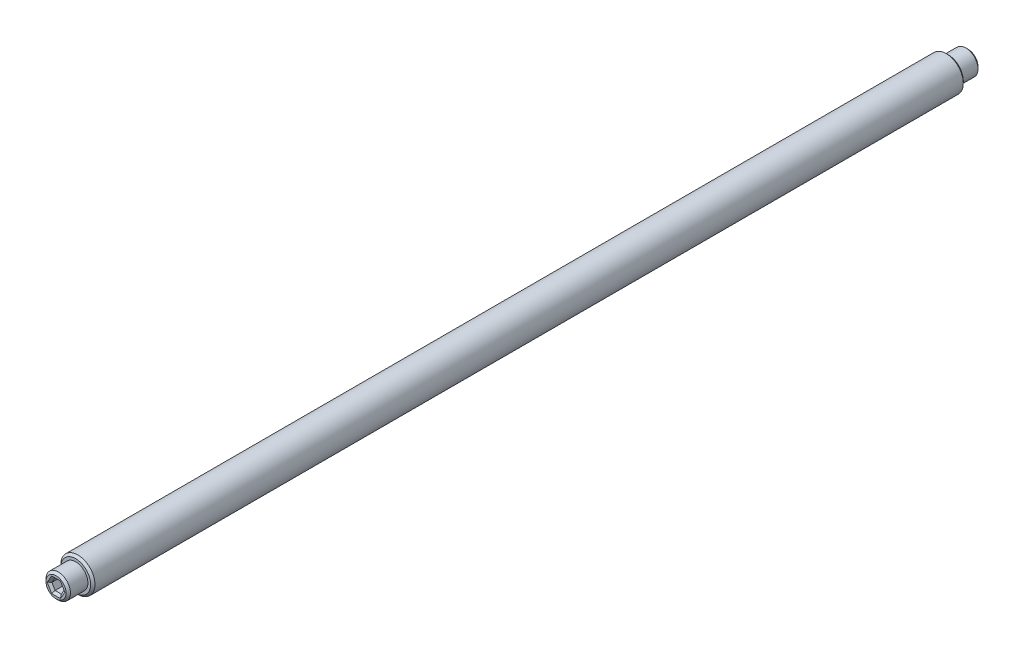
ISO-10303-21;
HEADER;
FILE_DESCRIPTION(('STEP AP214'),'2;1');
FILE_NAME('part.step','',(''),(''),'','','');
FILE_SCHEMA(('AUTOMOTIVE_DESIGN { 1 0 10303 214 1 1 1 1 }'));
ENDSEC;
DATA;
#1=APPLICATION_CONTEXT('core data for automotive mechanical design processes');
#2=APPLICATION_PROTOCOL_DEFINITION('international standard','automotive_design',2000,#1);
#3=PRODUCT_CONTEXT('',#1,'mechanical');
#4=PRODUCT('Part','Part','',(#3));
#5=PRODUCT_RELATED_PRODUCT_CATEGORY('part','',(#4));
#6=PRODUCT_DEFINITION_FORMATION('','',#4);
#7=PRODUCT_DEFINITION_CONTEXT('part definition',#1,'design');
#8=PRODUCT_DEFINITION('design','',#6,#7);
#9=PRODUCT_DEFINITION_SHAPE('','',#8);
#10=(LENGTH_UNIT() NAMED_UNIT(*) SI_UNIT(.MILLI.,.METRE.));
#11=(NAMED_UNIT(*) PLANE_ANGLE_UNIT() SI_UNIT($,.RADIAN.));
#12=(NAMED_UNIT(*) SI_UNIT($,.STERADIAN.) SOLID_ANGLE_UNIT());
#13=UNCERTAINTY_MEASURE_WITH_UNIT(LENGTH_MEASURE(1.E-05),#10,'distance_accuracy_value','');
#14=(GEOMETRIC_REPRESENTATION_CONTEXT(3) GLOBAL_UNCERTAINTY_ASSIGNED_CONTEXT((#13)) GLOBAL_UNIT_ASSIGNED_CONTEXT((#10,
#11,#12)) REPRESENTATION_CONTEXT('',''));
#15=CARTESIAN_POINT('',(0.,0.,0.));
#16=DIRECTION('',(0.,0.,1.));
#17=DIRECTION('',(1.,0.,0.));
#18=AXIS2_PLACEMENT_3D('',#15,#16,#17);
#19=CARTESIAN_POINT('',(-1.4224,0.,46.736));
#20=DIRECTION('',(0.,0.,1.));
#21=DIRECTION('',(0.,-1.,0.));
#22=AXIS2_PLACEMENT_3D('',#19,#20,#21);
#23=PLANE('',#22);
#24=CARTESIAN_POINT('',(0.,0.,46.736));
#25=DIRECTION('',(0.,0.,1.));
#26=DIRECTION('',(0.,-1.,0.));
#27=AXIS2_PLACEMENT_3D('',#24,#25,#26);
#28=CIRCLE('',#27,1.1684);
#29=CARTESIAN_POINT('',(0.,-1.1684,46.736));
#30=VERTEX_POINT('',#29);
#31=EDGE_CURVE('P0_E126',#30,#30,#28,.F.);
#32=ORIENTED_EDGE('',*,*,#31,.T.);
#33=EDGE_LOOP('',(#32));
#34=FACE_BOUND('',#33,.T.);
#35=ADVANCED_FACE('P0_F16',(#34),#23,.F.);
#36=CARTESIAN_POINT('',(0.,0.,53.086));
#37=DIRECTION('',(0.,0.,-1.));
#38=DIRECTION('',(0.,1.,0.));
#39=AXIS2_PLACEMENT_3D('',#36,#37,#38);
#40=PLANE('',#39);
#41=DIRECTION('',(0.5,-0.866025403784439,0.));
#42=VECTOR('',#41,1.);
#43=CARTESIAN_POINT('',(0.769896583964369,0.444499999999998,53.086));
#44=LINE('',#43,#42);
#45=CARTESIAN_POINT('',(0.513264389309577,0.889000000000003,53.086));
#46=VERTEX_POINT('',#45);
#47=CARTESIAN_POINT('',(1.02652877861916,0.,53.086));
#48=VERTEX_POINT('',#47);
#49=EDGE_CURVE('P0_E157',#46,#48,#44,.T.);
#50=ORIENTED_EDGE('',*,*,#49,.T.);
#51=DIRECTION('',(-0.5,-0.866025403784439,0.));
#52=VECTOR('',#51,1.);
#53=CARTESIAN_POINT('',(0.769896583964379,-0.444500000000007,53.086));
#54=LINE('',#53,#52);
#55=CARTESIAN_POINT('',(0.513264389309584,-0.889000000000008,53.086));
#56=VERTEX_POINT('',#55);
#57=EDGE_CURVE('P0_E159',#48,#56,#54,.T.);
#58=ORIENTED_EDGE('',*,*,#57,.T.);
#59=DIRECTION('',(-1.,0.,0.));
#60=VECTOR('',#59,1.);
#61=CARTESIAN_POINT('',(0.,-0.889000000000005,53.086));
#62=LINE('',#61,#60);
#63=CARTESIAN_POINT('',(-0.513264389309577,-0.889000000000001,53.086));
#64=VERTEX_POINT('',#63);
#65=EDGE_CURVE('P0_E149',#56,#64,#62,.T.);
#66=ORIENTED_EDGE('',*,*,#65,.T.);
#67=DIRECTION('',(-0.5,0.866025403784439,0.));
#68=VECTOR('',#67,1.);
#69=CARTESIAN_POINT('',(-0.769896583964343,-0.444500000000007,53.086));
#70=LINE('',#69,#68);
#71=CARTESIAN_POINT('',(-1.02652877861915,0.,53.086));
#72=VERTEX_POINT('',#71);
#73=EDGE_CURVE('P0_E151',#64,#72,#70,.T.);
#74=ORIENTED_EDGE('',*,*,#73,.T.);
#75=DIRECTION('',(0.5,0.866025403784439,0.));
#76=VECTOR('',#75,1.);
#77=CARTESIAN_POINT('',(-0.769896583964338,0.444499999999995,53.086));
#78=LINE('',#77,#76);
#79=CARTESIAN_POINT('',(-0.513264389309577,0.889000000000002,53.086));
#80=VERTEX_POINT('',#79);
#81=EDGE_CURVE('P0_E153',#72,#80,#78,.T.);
#82=ORIENTED_EDGE('',*,*,#81,.T.);
#83=DIRECTION('',(1.,0.,0.));
#84=VECTOR('',#83,1.);
#85=CARTESIAN_POINT('',(0.,0.888999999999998,53.086));
#86=LINE('',#85,#84);
#87=EDGE_CURVE('P0_E155',#80,#46,#86,.T.);
#88=ORIENTED_EDGE('',*,*,#87,.T.);
#89=EDGE_LOOP('',(#50,#58,#66,#74,#82,#88));
#90=FACE_BOUND('',#89,.T.);
#91=CARTESIAN_POINT('',(0.,0.,53.086));
#92=DIRECTION('',(0.,0.,-1.));
#93=DIRECTION('',(0.,1.,0.));
#94=AXIS2_PLACEMENT_3D('',#91,#92,#93);
#95=CIRCLE('',#94,1.1684);
#96=CARTESIAN_POINT('',(0.,1.1684,53.086));
#97=VERTEX_POINT('',#96);
#98=EDGE_CURVE('P0_E143',#97,#97,#95,.F.);
#99=ORIENTED_EDGE('',*,*,#98,.T.);
#100=EDGE_LOOP('',(#99));
#101=FACE_BOUND('',#100,.T.);
#102=ADVANCED_FACE('P0_F208',(#90,#101),#40,.F.);
#103=CARTESIAN_POINT('',(0.,0.,46.736));
#104=DIRECTION('',(0.,0.,-1.));
#105=DIRECTION('',(0.,1.,0.));
#106=AXIS2_PLACEMENT_3D('',#103,#104,#105);
#107=CYLINDRICAL_SURFACE('',#106,1.4224);
#108=CARTESIAN_POINT('',(0.,0.,46.99));
#109=DIRECTION('',(0.,0.,1.));
#110=DIRECTION('',(0.,-1.,0.));
#111=AXIS2_PLACEMENT_3D('',#108,#109,#110);
#112=CIRCLE('',#111,1.4224);
#113=CARTESIAN_POINT('',(0.,-1.4224,46.99));
#114=VERTEX_POINT('',#113);
#115=EDGE_CURVE('P0_E140',#114,#114,#112,.T.);
#116=ORIENTED_EDGE('',*,*,#115,.T.);
#117=EDGE_LOOP('',(#116));
#118=FACE_BOUND('',#117,.T.);
#119=CARTESIAN_POINT('',(0.,0.,52.832));
#120=DIRECTION('',(0.,0.,-1.));
#121=DIRECTION('',(0.,1.,0.));
#122=AXIS2_PLACEMENT_3D('',#119,#120,#121);
#123=CIRCLE('',#122,1.4224);
#124=CARTESIAN_POINT('',(0.,1.4224,52.832));
#125=VERTEX_POINT('',#124);
#126=EDGE_CURVE('P0_E137',#125,#125,#123,.T.);
#127=ORIENTED_EDGE('',*,*,#126,.T.);
#128=EDGE_LOOP('',(#127));
#129=FACE_BOUND('',#128,.T.);
#130=ADVANCED_FACE('P0_F211',(#118,#129),#107,.T.);
#131=CARTESIAN_POINT('',(0.,0.,46.736));
#132=DIRECTION('',(0.,0.,1.));
#133=DIRECTION('',(0.,-1.,0.));
#134=AXIS2_PLACEMENT_3D('',#131,#132,#133);
#135=CONICAL_SURFACE('',#134,1.1684,0.785398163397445);
#136=ORIENTED_EDGE('',*,*,#115,.F.);
#137=EDGE_LOOP('',(#136));
#138=FACE_BOUND('',#137,.T.);
#139=ORIENTED_EDGE('',*,*,#31,.F.);
#140=EDGE_LOOP('',(#139));
#141=FACE_BOUND('',#140,.T.);
#142=ADVANCED_FACE('P0_F218',(#138,#141),#135,.T.);
#143=CARTESIAN_POINT('',(0.,0.,52.832));
#144=DIRECTION('',(0.,0.,-1.));
#145=DIRECTION('',(0.,1.,0.));
#146=AXIS2_PLACEMENT_3D('',#143,#144,#145);
#147=CONICAL_SURFACE('',#146,1.4224,0.78539816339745);
#148=ORIENTED_EDGE('',*,*,#98,.F.);
#149=EDGE_LOOP('',(#148));
#150=FACE_BOUND('',#149,.T.);
#151=ORIENTED_EDGE('',*,*,#126,.F.);
#152=EDGE_LOOP('',(#151));
#153=FACE_BOUND('',#152,.T.);
#154=ADVANCED_FACE('P0_F215',(#150,#153),#147,.T.);
#155=CARTESIAN_POINT('',(0.733234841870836,0.,51.816));
#156=DIRECTION('',(0.866025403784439,0.5,0.));
#157=DIRECTION('',(-0.5,0.866025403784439,0.));
#158=AXIS2_PLACEMENT_3D('',#155,#156,#157);
#159=PLANE('',#158);
#160=DIRECTION('',(0.,0.,1.));
#161=VECTOR('',#160,1.);
#162=CARTESIAN_POINT('',(0.733234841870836,0.,51.816));
#163=LINE('',#162,#161);
#164=CARTESIAN_POINT('',(0.733234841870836,0.,51.816));
#165=VERTEX_POINT('',#164);
#166=CARTESIAN_POINT('',(0.733234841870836,0.,52.832));
#167=VERTEX_POINT('',#166);
#168=EDGE_CURVE('P0_E124',#165,#167,#163,.T.);
#169=ORIENTED_EDGE('',*,*,#168,.T.);
#170=DIRECTION('',(-0.5,0.866025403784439,0.));
#171=VECTOR('',#170,1.);
#172=CARTESIAN_POINT('',(0.733234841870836,0.,52.832));
#173=LINE('',#172,#171);
#174=CARTESIAN_POINT('',(0.366617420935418,0.635000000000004,52.832));
#175=VERTEX_POINT('',#174);
#176=EDGE_CURVE('P0_E96',#167,#175,#173,.T.);
#177=ORIENTED_EDGE('',*,*,#176,.T.);
#178=DIRECTION('',(0.,0.,1.));
#179=VECTOR('',#178,1.);
#180=CARTESIAN_POINT('',(0.366617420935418,0.635000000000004,51.816));
#181=LINE('',#180,#179);
#182=CARTESIAN_POINT('',(0.366617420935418,0.635000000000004,51.816));
#183=VERTEX_POINT('',#182);
#184=EDGE_CURVE('P0_E88',#183,#175,#181,.T.);
#185=ORIENTED_EDGE('',*,*,#184,.F.);
#186=DIRECTION('',(-0.5,0.866025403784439,0.));
#187=VECTOR('',#186,1.);
#188=CARTESIAN_POINT('',(0.733234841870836,0.,51.816));
#189=LINE('',#188,#187);
#190=EDGE_CURVE('P0_E93',#165,#183,#189,.T.);
#191=ORIENTED_EDGE('',*,*,#190,.F.);
#192=EDGE_LOOP('',(#169,#177,#185,#191));
#193=FACE_BOUND('',#192,.T.);
#194=ADVANCED_FACE('P0_F91',(#193),#159,.F.);
#195=CARTESIAN_POINT('',(0.366617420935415,-0.634999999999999,51.816));
#196=DIRECTION('',(0.866025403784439,-0.5,0.));
#197=DIRECTION('',(0.5,0.866025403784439,0.));
#198=AXIS2_PLACEMENT_3D('',#195,#196,#197);
#199=PLANE('',#198);
#200=DIRECTION('',(0.,0.,1.));
#201=VECTOR('',#200,1.);
#202=CARTESIAN_POINT('',(0.366617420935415,-0.634999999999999,51.816));
#203=LINE('',#202,#201);
#204=CARTESIAN_POINT('',(0.366617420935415,-0.634999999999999,51.816));
#205=VERTEX_POINT('',#204);
#206=CARTESIAN_POINT('',(0.366617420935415,-0.634999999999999,52.832));
#207=VERTEX_POINT('',#206);
#208=EDGE_CURVE('P0_E127',#205,#207,#203,.T.);
#209=ORIENTED_EDGE('',*,*,#208,.T.);
#210=DIRECTION('',(0.5,0.866025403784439,0.));
#211=VECTOR('',#210,1.);
#212=CARTESIAN_POINT('',(0.366617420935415,-0.634999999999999,52.832));
#213=LINE('',#212,#211);
#214=EDGE_CURVE('P0_E146',#207,#167,#213,.T.);
#215=ORIENTED_EDGE('',*,*,#214,.T.);
#216=ORIENTED_EDGE('',*,*,#168,.F.);
#217=DIRECTION('',(0.5,0.866025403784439,0.));
#218=VECTOR('',#217,1.);
#219=CARTESIAN_POINT('',(0.366617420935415,-0.634999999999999,51.816));
#220=LINE('',#219,#218);
#221=EDGE_CURVE('P0_E100',#205,#165,#220,.T.);
#222=ORIENTED_EDGE('',*,*,#221,.F.);
#223=EDGE_LOOP('',(#209,#215,#216,#222));
#224=FACE_BOUND('',#223,.T.);
#225=ADVANCED_FACE('P0_F199',(#224),#199,.F.);
#226=CARTESIAN_POINT('',(-0.366617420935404,-0.634999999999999,51.816));
#227=DIRECTION('',(0.,-1.,0.));
#228=DIRECTION('',(1.,0.,0.));
#229=AXIS2_PLACEMENT_3D('',#226,#227,#228);
#230=PLANE('',#229);
#231=DIRECTION('',(0.,0.,1.));
#232=VECTOR('',#231,1.);
#233=CARTESIAN_POINT('',(-0.366617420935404,-0.634999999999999,51.816));
#234=LINE('',#233,#232);
#235=CARTESIAN_POINT('',(-0.366617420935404,-0.634999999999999,51.816));
#236=VERTEX_POINT('',#235);
#237=CARTESIAN_POINT('',(-0.366617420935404,-0.634999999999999,52.832));
#238=VERTEX_POINT('',#237);
#239=EDGE_CURVE('P0_E130',#236,#238,#234,.T.);
#240=ORIENTED_EDGE('',*,*,#239,.T.);
#241=DIRECTION('',(1.,0.,0.));
#242=VECTOR('',#241,1.);
#243=CARTESIAN_POINT('',(-0.366617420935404,-0.634999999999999,52.832));
#244=LINE('',#243,#242);
#245=EDGE_CURVE('P0_E11',#238,#207,#244,.T.);
#246=ORIENTED_EDGE('',*,*,#245,.T.);
#247=ORIENTED_EDGE('',*,*,#208,.F.);
#248=DIRECTION('',(1.,0.,0.));
#249=VECTOR('',#248,1.);
#250=CARTESIAN_POINT('',(-0.366617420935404,-0.634999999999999,51.816));
#251=LINE('',#250,#249);
#252=EDGE_CURVE('P0_E121',#236,#205,#251,.T.);
#253=ORIENTED_EDGE('',*,*,#252,.F.);
#254=EDGE_LOOP('',(#240,#246,#247,#253));
#255=FACE_BOUND('',#254,.T.);
#256=ADVANCED_FACE('P0_F196',(#255),#230,.F.);
#257=CARTESIAN_POINT('',(-0.733234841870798,0.,51.816));
#258=DIRECTION('',(-0.866025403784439,-0.5,0.));
#259=DIRECTION('',(0.5,-0.866025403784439,0.));
#260=AXIS2_PLACEMENT_3D('',#257,#258,#259);
#261=PLANE('',#260);
#262=DIRECTION('',(0.,0.,1.));
#263=VECTOR('',#262,1.);
#264=CARTESIAN_POINT('',(-0.733234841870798,0.,51.816));
#265=LINE('',#264,#263);
#266=CARTESIAN_POINT('',(-0.733234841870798,0.,51.816));
#267=VERTEX_POINT('',#266);
#268=CARTESIAN_POINT('',(-0.733234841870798,0.,52.832));
#269=VERTEX_POINT('',#268);
#270=EDGE_CURVE('P0_E132',#267,#269,#265,.T.);
#271=ORIENTED_EDGE('',*,*,#270,.T.);
#272=DIRECTION('',(0.5,-0.866025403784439,0.));
#273=VECTOR('',#272,1.);
#274=CARTESIAN_POINT('',(-0.733234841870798,0.,52.832));
#275=LINE('',#274,#273);
#276=EDGE_CURVE('P0_E25',#269,#238,#275,.T.);
#277=ORIENTED_EDGE('',*,*,#276,.T.);
#278=ORIENTED_EDGE('',*,*,#239,.F.);
#279=DIRECTION('',(0.5,-0.866025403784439,0.));
#280=VECTOR('',#279,1.);
#281=CARTESIAN_POINT('',(-0.733234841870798,0.,51.816));
#282=LINE('',#281,#280);
#283=EDGE_CURVE('P0_E118',#267,#236,#282,.T.);
#284=ORIENTED_EDGE('',*,*,#283,.F.);
#285=EDGE_LOOP('',(#271,#277,#278,#284));
#286=FACE_BOUND('',#285,.T.);
#287=ADVANCED_FACE('P0_F263',(#286),#261,.F.);
#288=CARTESIAN_POINT('',(-0.366617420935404,0.635000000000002,51.816));
#289=DIRECTION('',(-0.866025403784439,0.5,0.));
#290=DIRECTION('',(-0.5,-0.866025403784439,0.));
#291=AXIS2_PLACEMENT_3D('',#288,#289,#290);
#292=PLANE('',#291);
#293=DIRECTION('',(0.,0.,1.));
#294=VECTOR('',#293,1.);
#295=CARTESIAN_POINT('',(-0.366617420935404,0.635000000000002,51.816));
#296=LINE('',#295,#294);
#297=CARTESIAN_POINT('',(-0.366617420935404,0.635000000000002,51.816));
#298=VERTEX_POINT('',#297);
#299=CARTESIAN_POINT('',(-0.366617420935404,0.635000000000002,52.832));
#300=VERTEX_POINT('',#299);
#301=EDGE_CURVE('P0_E99',#298,#300,#296,.T.);
#302=ORIENTED_EDGE('',*,*,#301,.T.);
#303=DIRECTION('',(-0.5,-0.866025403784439,0.));
#304=VECTOR('',#303,1.);
#305=CARTESIAN_POINT('',(-0.366617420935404,0.635000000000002,52.832));
#306=LINE('',#305,#304);
#307=EDGE_CURVE('P0_E40',#300,#269,#306,.T.);
#308=ORIENTED_EDGE('',*,*,#307,.T.);
#309=ORIENTED_EDGE('',*,*,#270,.F.);
#310=DIRECTION('',(-0.5,-0.866025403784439,0.));
#311=VECTOR('',#310,1.);
#312=CARTESIAN_POINT('',(-0.366617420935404,0.635000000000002,51.816));
#313=LINE('',#312,#311);
#314=EDGE_CURVE('P0_E108',#298,#267,#313,.T.);
#315=ORIENTED_EDGE('',*,*,#314,.F.);
#316=EDGE_LOOP('',(#302,#308,#309,#315));
#317=FACE_BOUND('',#316,.T.);
#318=ADVANCED_FACE('P0_F256',(#317),#292,.F.);
#319=CARTESIAN_POINT('',(0.366617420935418,0.635000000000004,51.816));
#320=DIRECTION('',(0.,1.,0.));
#321=DIRECTION('',(-1.,0.,0.));
#322=AXIS2_PLACEMENT_3D('',#319,#320,#321);
#323=PLANE('',#322);
#324=ORIENTED_EDGE('',*,*,#184,.T.);
#325=DIRECTION('',(-1.,0.,0.));
#326=VECTOR('',#325,1.);
#327=CARTESIAN_POINT('',(0.366617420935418,0.635000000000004,52.832));
#328=LINE('',#327,#326);
#329=EDGE_CURVE('P0_E163',#175,#300,#328,.T.);
#330=ORIENTED_EDGE('',*,*,#329,.T.);
#331=ORIENTED_EDGE('',*,*,#301,.F.);
#332=DIRECTION('',(-1.,0.,0.));
#333=VECTOR('',#332,1.);
#334=CARTESIAN_POINT('',(0.366617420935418,0.635000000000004,51.816));
#335=LINE('',#334,#333);
#336=EDGE_CURVE('P0_E103',#183,#298,#335,.T.);
#337=ORIENTED_EDGE('',*,*,#336,.F.);
#338=EDGE_LOOP('',(#324,#330,#331,#337));
#339=FACE_BOUND('',#338,.T.);
#340=ADVANCED_FACE('P0_F104',(#339),#323,.F.);
#341=CARTESIAN_POINT('',(1.09985226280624,-0.635000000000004,51.816));
#342=DIRECTION('',(0.,0.,-1.));
#343=DIRECTION('',(0.,1.,0.));
#344=AXIS2_PLACEMENT_3D('',#341,#342,#343);
#345=PLANE('',#344);
#346=ORIENTED_EDGE('',*,*,#190,.T.);
#347=ORIENTED_EDGE('',*,*,#336,.T.);
#348=ORIENTED_EDGE('',*,*,#314,.T.);
#349=ORIENTED_EDGE('',*,*,#283,.T.);
#350=ORIENTED_EDGE('',*,*,#252,.T.);
#351=ORIENTED_EDGE('',*,*,#221,.T.);
#352=EDGE_LOOP('',(#346,#347,#348,#349,#350,#351));
#353=FACE_BOUND('',#352,.T.);
#354=ADVANCED_FACE('P0_F110',(#353),#345,.F.);
#355=CARTESIAN_POINT('',(-0.366617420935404,0.635000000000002,52.832));
#356=DIRECTION('',(-0.612372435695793,0.353553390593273,-0.707106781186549));
#357=DIRECTION('',(0.755928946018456,0.,-0.654653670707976));
#358=AXIS2_PLACEMENT_3D('',#355,#356,#357);
#359=PLANE('',#358);
#360=DIRECTION('',(-0.377964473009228,0.654653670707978,0.654653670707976));
#361=VECTOR('',#360,1.);
#362=CARTESIAN_POINT('',(-0.261869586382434,0.453571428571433,52.6505714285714));
#363=LINE('',#362,#361);
#364=EDGE_CURVE('P0_E115',#80,#300,#363,.F.);
#365=ORIENTED_EDGE('',*,*,#364,.F.);
#366=ORIENTED_EDGE('',*,*,#81,.F.);
#367=DIRECTION('',(-0.755928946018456,0.,0.654653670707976));
#368=VECTOR('',#367,1.);
#369=CARTESIAN_POINT('',(-0.523739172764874,0.,52.6505714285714));
#370=LINE('',#369,#368);
#371=EDGE_CURVE('P0_E20',#269,#72,#370,.T.);
#372=ORIENTED_EDGE('',*,*,#371,.F.);
#373=ORIENTED_EDGE('',*,*,#307,.F.);
#374=EDGE_LOOP('',(#365,#366,#372,#373));
#375=FACE_BOUND('',#374,.T.);
#376=ADVANCED_FACE('P0_F18',(#375),#359,.F.);
#377=CARTESIAN_POINT('',(-0.733234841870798,0.,52.832));
#378=DIRECTION('',(-0.612372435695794,-0.353553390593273,-0.707106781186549));
#379=DIRECTION('',(0.755928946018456,0.,-0.654653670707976));
#380=AXIS2_PLACEMENT_3D('',#377,#378,#379);
#381=PLANE('',#380);
#382=ORIENTED_EDGE('',*,*,#371,.T.);
#383=ORIENTED_EDGE('',*,*,#73,.F.);
#384=DIRECTION('',(-0.377964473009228,-0.654653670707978,0.654653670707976));
#385=VECTOR('',#384,1.);
#386=CARTESIAN_POINT('',(-0.261869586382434,-0.453571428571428,52.6505714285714));
#387=LINE('',#386,#385);
#388=EDGE_CURVE('P0_E174',#238,#64,#387,.T.);
#389=ORIENTED_EDGE('',*,*,#388,.F.);
#390=ORIENTED_EDGE('',*,*,#276,.F.);
#391=EDGE_LOOP('',(#382,#383,#389,#390));
#392=FACE_BOUND('',#391,.T.);
#393=ADVANCED_FACE('P0_F188',(#392),#381,.F.);
#394=CARTESIAN_POINT('',(0.366617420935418,0.635000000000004,52.832));
#395=DIRECTION('',(0.,0.707106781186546,-0.707106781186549));
#396=DIRECTION('',(0.,0.707106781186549,0.707106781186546));
#397=AXIS2_PLACEMENT_3D('',#394,#395,#396);
#398=PLANE('',#397);
#399=ORIENTED_EDGE('',*,*,#364,.T.);
#400=ORIENTED_EDGE('',*,*,#329,.F.);
#401=DIRECTION('',(0.377964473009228,0.654653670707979,0.654653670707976));
#402=VECTOR('',#401,1.);
#403=CARTESIAN_POINT('',(0.261869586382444,0.453571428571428,52.6505714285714));
#404=LINE('',#403,#402);
#405=EDGE_CURVE('P0_E171',#46,#175,#404,.F.);
#406=ORIENTED_EDGE('',*,*,#405,.F.);
#407=ORIENTED_EDGE('',*,*,#87,.F.);
#408=EDGE_LOOP('',(#399,#400,#406,#407));
#409=FACE_BOUND('',#408,.T.);
#410=ADVANCED_FACE('P0_F180',(#409),#398,.F.);
#411=CARTESIAN_POINT('',(-0.366617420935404,-0.634999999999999,52.832));
#412=DIRECTION('',(0.,-0.707106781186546,-0.707106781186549));
#413=DIRECTION('',(0.,0.707106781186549,-0.707106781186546));
#414=AXIS2_PLACEMENT_3D('',#411,#412,#413);
#415=PLANE('',#414);
#416=ORIENTED_EDGE('',*,*,#388,.T.);
#417=ORIENTED_EDGE('',*,*,#65,.F.);
#418=DIRECTION('',(-0.377964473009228,0.654653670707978,-0.654653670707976));
#419=VECTOR('',#418,1.);
#420=CARTESIAN_POINT('',(0.366617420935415,-0.634999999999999,52.832));
#421=LINE('',#420,#419);
#422=EDGE_CURVE('P0_E169',#207,#56,#421,.F.);
#423=ORIENTED_EDGE('',*,*,#422,.F.);
#424=ORIENTED_EDGE('',*,*,#245,.F.);
#425=EDGE_LOOP('',(#416,#417,#423,#424));
#426=FACE_BOUND('',#425,.T.);
#427=ADVANCED_FACE('P0_F193',(#426),#415,.F.);
#428=CARTESIAN_POINT('',(0.733234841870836,0.,52.832));
#429=DIRECTION('',(0.612372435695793,0.353553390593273,-0.707106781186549));
#430=DIRECTION('',(0.755928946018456,0.,0.654653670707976));
#431=AXIS2_PLACEMENT_3D('',#428,#429,#430);
#432=PLANE('',#431);
#433=ORIENTED_EDGE('',*,*,#405,.T.);
#434=ORIENTED_EDGE('',*,*,#176,.F.);
#435=DIRECTION('',(0.755928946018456,0.,0.654653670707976));
#436=VECTOR('',#435,1.);
#437=CARTESIAN_POINT('',(0.523739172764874,0.,52.6505714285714));
#438=LINE('',#437,#436);
#439=EDGE_CURVE('P0_E167',#48,#167,#438,.F.);
#440=ORIENTED_EDGE('',*,*,#439,.F.);
#441=ORIENTED_EDGE('',*,*,#49,.F.);
#442=EDGE_LOOP('',(#433,#434,#440,#441));
#443=FACE_BOUND('',#442,.T.);
#444=ADVANCED_FACE('P0_F206',(#443),#432,.F.);
#445=CARTESIAN_POINT('',(0.366617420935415,-0.634999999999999,52.832));
#446=DIRECTION('',(0.612372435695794,-0.353553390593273,-0.707106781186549));
#447=DIRECTION('',(0.755928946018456,0.,0.654653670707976));
#448=AXIS2_PLACEMENT_3D('',#445,#446,#447);
#449=PLANE('',#448);
#450=ORIENTED_EDGE('',*,*,#422,.T.);
#451=ORIENTED_EDGE('',*,*,#57,.F.);
#452=ORIENTED_EDGE('',*,*,#439,.T.);
#453=ORIENTED_EDGE('',*,*,#214,.F.);
#454=EDGE_LOOP('',(#450,#451,#452,#453));
#455=FACE_BOUND('',#454,.T.);
#456=ADVANCED_FACE('P0_F201',(#455),#449,.F.);
#457=CLOSED_SHELL('',(#35,#102,#130,#142,#154,#194,#225,#256,#287,#318,#340,#354,#376,#393,#410,
#427,#444,#456));
#458=MANIFOLD_SOLID_BREP('P0_B1',#457);
#459=CARTESIAN_POINT('',(-1.4224,0.,-46.736));
#460=DIRECTION('',(0.,0.,-1.));
#461=DIRECTION('',(0.,1.,0.));
#462=AXIS2_PLACEMENT_3D('',#459,#460,#461);
#463=PLANE('',#462);
#464=CARTESIAN_POINT('',(0.,0.,-46.736));
#465=DIRECTION('',(0.,0.,-1.));
#466=DIRECTION('',(0.,1.,0.));
#467=AXIS2_PLACEMENT_3D('',#464,#465,#466);
#468=CIRCLE('',#467,1.1684);
#469=CARTESIAN_POINT('',(0.,1.1684,-46.736));
#470=VERTEX_POINT('',#469);
#471=EDGE_CURVE('P1_E126',#470,#470,#468,.F.);
#472=ORIENTED_EDGE('',*,*,#471,.T.);
#473=EDGE_LOOP('',(#472));
#474=FACE_BOUND('',#473,.T.);
#475=ADVANCED_FACE('P1_F16',(#474),#463,.F.);
#476=CARTESIAN_POINT('',(0.,0.,-53.086));
#477=DIRECTION('',(0.,0.,1.));
#478=DIRECTION('',(0.,-1.,0.));
#479=AXIS2_PLACEMENT_3D('',#476,#477,#478);
#480=PLANE('',#479);
#481=DIRECTION('',(0.5,0.866025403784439,0.));
#482=VECTOR('',#481,1.);
#483=CARTESIAN_POINT('',(0.769896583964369,-0.444499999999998,-53.086));
#484=LINE('',#483,#482);
#485=CARTESIAN_POINT('',(0.513264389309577,-0.889000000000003,-53.086));
#486=VERTEX_POINT('',#485);
#487=CARTESIAN_POINT('',(1.02652877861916,0.,-53.086));
#488=VERTEX_POINT('',#487);
#489=EDGE_CURVE('P1_E157',#486,#488,#484,.T.);
#490=ORIENTED_EDGE('',*,*,#489,.T.);
#491=DIRECTION('',(-0.5,0.866025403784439,0.));
#492=VECTOR('',#491,1.);
#493=CARTESIAN_POINT('',(0.769896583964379,0.444500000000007,-53.086));
#494=LINE('',#493,#492);
#495=CARTESIAN_POINT('',(0.513264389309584,0.889000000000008,-53.086));
#496=VERTEX_POINT('',#495);
#497=EDGE_CURVE('P1_E159',#488,#496,#494,.T.);
#498=ORIENTED_EDGE('',*,*,#497,.T.);
#499=DIRECTION('',(-1.,0.,0.));
#500=VECTOR('',#499,1.);
#501=CARTESIAN_POINT('',(0.,0.889000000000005,-53.086));
#502=LINE('',#501,#500);
#503=CARTESIAN_POINT('',(-0.513264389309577,0.889000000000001,-53.086));
#504=VERTEX_POINT('',#503);
#505=EDGE_CURVE('P1_E149',#496,#504,#502,.T.);
#506=ORIENTED_EDGE('',*,*,#505,.T.);
#507=DIRECTION('',(-0.5,-0.866025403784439,0.));
#508=VECTOR('',#507,1.);
#509=CARTESIAN_POINT('',(-0.769896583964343,0.444500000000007,-53.086));
#510=LINE('',#509,#508);
#511=CARTESIAN_POINT('',(-1.02652877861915,0.,-53.086));
#512=VERTEX_POINT('',#511);
#513=EDGE_CURVE('P1_E151',#504,#512,#510,.T.);
#514=ORIENTED_EDGE('',*,*,#513,.T.);
#515=DIRECTION('',(0.5,-0.866025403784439,0.));
#516=VECTOR('',#515,1.);
#517=CARTESIAN_POINT('',(-0.769896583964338,-0.444499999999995,-53.086));
#518=LINE('',#517,#516);
#519=CARTESIAN_POINT('',(-0.513264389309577,-0.889000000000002,-53.086));
#520=VERTEX_POINT('',#519);
#521=EDGE_CURVE('P1_E153',#512,#520,#518,.T.);
#522=ORIENTED_EDGE('',*,*,#521,.T.);
#523=DIRECTION('',(1.,0.,0.));
#524=VECTOR('',#523,1.);
#525=CARTESIAN_POINT('',(0.,-0.888999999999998,-53.086));
#526=LINE('',#525,#524);
#527=EDGE_CURVE('P1_E155',#520,#486,#526,.T.);
#528=ORIENTED_EDGE('',*,*,#527,.T.);
#529=EDGE_LOOP('',(#490,#498,#506,#514,#522,#528));
#530=FACE_BOUND('',#529,.T.);
#531=CARTESIAN_POINT('',(0.,0.,-53.086));
#532=DIRECTION('',(0.,0.,1.));
#533=DIRECTION('',(0.,-1.,0.));
#534=AXIS2_PLACEMENT_3D('',#531,#532,#533);
#535=CIRCLE('',#534,1.1684);
#536=CARTESIAN_POINT('',(0.,-1.1684,-53.086));
#537=VERTEX_POINT('',#536);
#538=EDGE_CURVE('P1_E143',#537,#537,#535,.F.);
#539=ORIENTED_EDGE('',*,*,#538,.T.);
#540=EDGE_LOOP('',(#539));
#541=FACE_BOUND('',#540,.T.);
#542=ADVANCED_FACE('P1_F208',(#530,#541),#480,.F.);
#543=CARTESIAN_POINT('',(0.,0.,-46.736));
#544=DIRECTION('',(0.,0.,1.));
#545=DIRECTION('',(0.,-1.,0.));
#546=AXIS2_PLACEMENT_3D('',#543,#544,#545);
#547=CYLINDRICAL_SURFACE('',#546,1.4224);
#548=CARTESIAN_POINT('',(0.,0.,-46.99));
#549=DIRECTION('',(0.,0.,-1.));
#550=DIRECTION('',(0.,1.,0.));
#551=AXIS2_PLACEMENT_3D('',#548,#549,#550);
#552=CIRCLE('',#551,1.4224);
#553=CARTESIAN_POINT('',(0.,1.4224,-46.99));
#554=VERTEX_POINT('',#553);
#555=EDGE_CURVE('P1_E140',#554,#554,#552,.T.);
#556=ORIENTED_EDGE('',*,*,#555,.T.);
#557=EDGE_LOOP('',(#556));
#558=FACE_BOUND('',#557,.T.);
#559=CARTESIAN_POINT('',(0.,0.,-52.832));
#560=DIRECTION('',(0.,0.,1.));
#561=DIRECTION('',(0.,-1.,0.));
#562=AXIS2_PLACEMENT_3D('',#559,#560,#561);
#563=CIRCLE('',#562,1.4224);
#564=CARTESIAN_POINT('',(0.,-1.4224,-52.832));
#565=VERTEX_POINT('',#564);
#566=EDGE_CURVE('P1_E137',#565,#565,#563,.T.);
#567=ORIENTED_EDGE('',*,*,#566,.T.);
#568=EDGE_LOOP('',(#567));
#569=FACE_BOUND('',#568,.T.);
#570=ADVANCED_FACE('P1_F211',(#558,#569),#547,.T.);
#571=CARTESIAN_POINT('',(0.,0.,-46.736));
#572=DIRECTION('',(0.,0.,-1.));
#573=DIRECTION('',(0.,1.,0.));
#574=AXIS2_PLACEMENT_3D('',#571,#572,#573);
#575=CONICAL_SURFACE('',#574,1.1684,0.785398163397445);
#576=ORIENTED_EDGE('',*,*,#555,.F.);
#577=EDGE_LOOP('',(#576));
#578=FACE_BOUND('',#577,.T.);
#579=ORIENTED_EDGE('',*,*,#471,.F.);
#580=EDGE_LOOP('',(#579));
#581=FACE_BOUND('',#580,.T.);
#582=ADVANCED_FACE('P1_F218',(#578,#581),#575,.T.);
#583=CARTESIAN_POINT('',(0.,0.,-52.832));
#584=DIRECTION('',(0.,0.,1.));
#585=DIRECTION('',(0.,-1.,0.));
#586=AXIS2_PLACEMENT_3D('',#583,#584,#585);
#587=CONICAL_SURFACE('',#586,1.4224,0.78539816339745);
#588=ORIENTED_EDGE('',*,*,#538,.F.);
#589=EDGE_LOOP('',(#588));
#590=FACE_BOUND('',#589,.T.);
#591=ORIENTED_EDGE('',*,*,#566,.F.);
#592=EDGE_LOOP('',(#591));
#593=FACE_BOUND('',#592,.T.);
#594=ADVANCED_FACE('P1_F215',(#590,#593),#587,.T.);
#595=CARTESIAN_POINT('',(0.733234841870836,0.,-51.816));
#596=DIRECTION('',(0.866025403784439,-0.5,0.));
#597=DIRECTION('',(-0.5,-0.866025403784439,0.));
#598=AXIS2_PLACEMENT_3D('',#595,#596,#597);
#599=PLANE('',#598);
#600=DIRECTION('',(0.,0.,-1.));
#601=VECTOR('',#600,1.);
#602=CARTESIAN_POINT('',(0.733234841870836,0.,-51.816));
#603=LINE('',#602,#601);
#604=CARTESIAN_POINT('',(0.733234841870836,0.,-51.816));
#605=VERTEX_POINT('',#604);
#606=CARTESIAN_POINT('',(0.733234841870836,0.,-52.832));
#607=VERTEX_POINT('',#606);
#608=EDGE_CURVE('P1_E124',#605,#607,#603,.T.);
#609=ORIENTED_EDGE('',*,*,#608,.T.);
#610=DIRECTION('',(-0.5,-0.866025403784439,0.));
#611=VECTOR('',#610,1.);
#612=CARTESIAN_POINT('',(0.733234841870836,0.,-52.832));
#613=LINE('',#612,#611);
#614=CARTESIAN_POINT('',(0.366617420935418,-0.635000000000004,-52.832));
#615=VERTEX_POINT('',#614);
#616=EDGE_CURVE('P1_E96',#607,#615,#613,.T.);
#617=ORIENTED_EDGE('',*,*,#616,.T.);
#618=DIRECTION('',(0.,0.,-1.));
#619=VECTOR('',#618,1.);
#620=CARTESIAN_POINT('',(0.366617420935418,-0.635000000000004,-51.816));
#621=LINE('',#620,#619);
#622=CARTESIAN_POINT('',(0.366617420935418,-0.635000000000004,-51.816));
#623=VERTEX_POINT('',#622);
#624=EDGE_CURVE('P1_E88',#623,#615,#621,.T.);
#625=ORIENTED_EDGE('',*,*,#624,.F.);
#626=DIRECTION('',(-0.5,-0.866025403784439,0.));
#627=VECTOR('',#626,1.);
#628=CARTESIAN_POINT('',(0.733234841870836,0.,-51.816));
#629=LINE('',#628,#627);
#630=EDGE_CURVE('P1_E93',#605,#623,#629,.T.);
#631=ORIENTED_EDGE('',*,*,#630,.F.);
#632=EDGE_LOOP('',(#609,#617,#625,#631));
#633=FACE_BOUND('',#632,.T.);
#634=ADVANCED_FACE('P1_F91',(#633),#599,.F.);
#635=CARTESIAN_POINT('',(0.366617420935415,0.634999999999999,-51.816));
#636=DIRECTION('',(0.866025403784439,0.5,0.));
#637=DIRECTION('',(0.5,-0.866025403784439,0.));
#638=AXIS2_PLACEMENT_3D('',#635,#636,#637);
#639=PLANE('',#638);
#640=DIRECTION('',(0.,0.,-1.));
#641=VECTOR('',#640,1.);
#642=CARTESIAN_POINT('',(0.366617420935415,0.634999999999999,-51.816));
#643=LINE('',#642,#641);
#644=CARTESIAN_POINT('',(0.366617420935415,0.634999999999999,-51.816));
#645=VERTEX_POINT('',#644);
#646=CARTESIAN_POINT('',(0.366617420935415,0.634999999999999,-52.832));
#647=VERTEX_POINT('',#646);
#648=EDGE_CURVE('P1_E127',#645,#647,#643,.T.);
#649=ORIENTED_EDGE('',*,*,#648,.T.);
#650=DIRECTION('',(0.5,-0.866025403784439,0.));
#651=VECTOR('',#650,1.);
#652=CARTESIAN_POINT('',(0.366617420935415,0.634999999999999,-52.832));
#653=LINE('',#652,#651);
#654=EDGE_CURVE('P1_E146',#647,#607,#653,.T.);
#655=ORIENTED_EDGE('',*,*,#654,.T.);
#656=ORIENTED_EDGE('',*,*,#608,.F.);
#657=DIRECTION('',(0.5,-0.866025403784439,0.));
#658=VECTOR('',#657,1.);
#659=CARTESIAN_POINT('',(0.366617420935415,0.634999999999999,-51.816));
#660=LINE('',#659,#658);
#661=EDGE_CURVE('P1_E100',#645,#605,#660,.T.);
#662=ORIENTED_EDGE('',*,*,#661,.F.);
#663=EDGE_LOOP('',(#649,#655,#656,#662));
#664=FACE_BOUND('',#663,.T.);
#665=ADVANCED_FACE('P1_F199',(#664),#639,.F.);
#666=CARTESIAN_POINT('',(-0.366617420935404,0.634999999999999,-51.816));
#667=DIRECTION('',(0.,1.,0.));
#668=DIRECTION('',(1.,0.,0.));
#669=AXIS2_PLACEMENT_3D('',#666,#667,#668);
#670=PLANE('',#669);
#671=DIRECTION('',(0.,0.,-1.));
#672=VECTOR('',#671,1.);
#673=CARTESIAN_POINT('',(-0.366617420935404,0.634999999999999,-51.816));
#674=LINE('',#673,#672);
#675=CARTESIAN_POINT('',(-0.366617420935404,0.634999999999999,-51.816));
#676=VERTEX_POINT('',#675);
#677=CARTESIAN_POINT('',(-0.366617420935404,0.634999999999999,-52.832));
#678=VERTEX_POINT('',#677);
#679=EDGE_CURVE('P1_E130',#676,#678,#674,.T.);
#680=ORIENTED_EDGE('',*,*,#679,.T.);
#681=DIRECTION('',(1.,0.,0.));
#682=VECTOR('',#681,1.);
#683=CARTESIAN_POINT('',(-0.366617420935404,0.634999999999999,-52.832));
#684=LINE('',#683,#682);
#685=EDGE_CURVE('P1_E11',#678,#647,#684,.T.);
#686=ORIENTED_EDGE('',*,*,#685,.T.);
#687=ORIENTED_EDGE('',*,*,#648,.F.);
#688=DIRECTION('',(1.,0.,0.));
#689=VECTOR('',#688,1.);
#690=CARTESIAN_POINT('',(-0.366617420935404,0.634999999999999,-51.816));
#691=LINE('',#690,#689);
#692=EDGE_CURVE('P1_E121',#676,#645,#691,.T.);
#693=ORIENTED_EDGE('',*,*,#692,.F.);
#694=EDGE_LOOP('',(#680,#686,#687,#693));
#695=FACE_BOUND('',#694,.T.);
#696=ADVANCED_FACE('P1_F196',(#695),#670,.F.);
#697=CARTESIAN_POINT('',(-0.733234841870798,0.,-51.816));
#698=DIRECTION('',(-0.866025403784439,0.5,0.));
#699=DIRECTION('',(0.5,0.866025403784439,0.));
#700=AXIS2_PLACEMENT_3D('',#697,#698,#699);
#701=PLANE('',#700);
#702=DIRECTION('',(0.,0.,-1.));
#703=VECTOR('',#702,1.);
#704=CARTESIAN_POINT('',(-0.733234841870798,0.,-51.816));
#705=LINE('',#704,#703);
#706=CARTESIAN_POINT('',(-0.733234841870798,0.,-51.816));
#707=VERTEX_POINT('',#706);
#708=CARTESIAN_POINT('',(-0.733234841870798,0.,-52.832));
#709=VERTEX_POINT('',#708);
#710=EDGE_CURVE('P1_E132',#707,#709,#705,.T.);
#711=ORIENTED_EDGE('',*,*,#710,.T.);
#712=DIRECTION('',(0.5,0.866025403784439,0.));
#713=VECTOR('',#712,1.);
#714=CARTESIAN_POINT('',(-0.733234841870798,0.,-52.832));
#715=LINE('',#714,#713);
#716=EDGE_CURVE('P1_E25',#709,#678,#715,.T.);
#717=ORIENTED_EDGE('',*,*,#716,.T.);
#718=ORIENTED_EDGE('',*,*,#679,.F.);
#719=DIRECTION('',(0.5,0.866025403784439,0.));
#720=VECTOR('',#719,1.);
#721=CARTESIAN_POINT('',(-0.733234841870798,0.,-51.816));
#722=LINE('',#721,#720);
#723=EDGE_CURVE('P1_E118',#707,#676,#722,.T.);
#724=ORIENTED_EDGE('',*,*,#723,.F.);
#725=EDGE_LOOP('',(#711,#717,#718,#724));
#726=FACE_BOUND('',#725,.T.);
#727=ADVANCED_FACE('P1_F263',(#726),#701,.F.);
#728=CARTESIAN_POINT('',(-0.366617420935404,-0.635000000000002,-51.816));
#729=DIRECTION('',(-0.866025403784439,-0.5,0.));
#730=DIRECTION('',(-0.5,0.866025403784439,0.));
#731=AXIS2_PLACEMENT_3D('',#728,#729,#730);
#732=PLANE('',#731);
#733=DIRECTION('',(0.,0.,-1.));
#734=VECTOR('',#733,1.);
#735=CARTESIAN_POINT('',(-0.366617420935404,-0.635000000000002,-51.816));
#736=LINE('',#735,#734);
#737=CARTESIAN_POINT('',(-0.366617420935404,-0.635000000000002,-51.816));
#738=VERTEX_POINT('',#737);
#739=CARTESIAN_POINT('',(-0.366617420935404,-0.635000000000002,-52.832));
#740=VERTEX_POINT('',#739);
#741=EDGE_CURVE('P1_E99',#738,#740,#736,.T.);
#742=ORIENTED_EDGE('',*,*,#741,.T.);
#743=DIRECTION('',(-0.5,0.866025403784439,0.));
#744=VECTOR('',#743,1.);
#745=CARTESIAN_POINT('',(-0.366617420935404,-0.635000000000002,-52.832));
#746=LINE('',#745,#744);
#747=EDGE_CURVE('P1_E40',#740,#709,#746,.T.);
#748=ORIENTED_EDGE('',*,*,#747,.T.);
#749=ORIENTED_EDGE('',*,*,#710,.F.);
#750=DIRECTION('',(-0.5,0.866025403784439,0.));
#751=VECTOR('',#750,1.);
#752=CARTESIAN_POINT('',(-0.366617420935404,-0.635000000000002,-51.816));
#753=LINE('',#752,#751);
#754=EDGE_CURVE('P1_E108',#738,#707,#753,.T.);
#755=ORIENTED_EDGE('',*,*,#754,.F.);
#756=EDGE_LOOP('',(#742,#748,#749,#755));
#757=FACE_BOUND('',#756,.T.);
#758=ADVANCED_FACE('P1_F256',(#757),#732,.F.);
#759=CARTESIAN_POINT('',(0.366617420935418,-0.635000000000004,-51.816));
#760=DIRECTION('',(0.,-1.,0.));
#761=DIRECTION('',(-1.,0.,0.));
#762=AXIS2_PLACEMENT_3D('',#759,#760,#761);
#763=PLANE('',#762);
#764=ORIENTED_EDGE('',*,*,#624,.T.);
#765=DIRECTION('',(-1.,0.,0.));
#766=VECTOR('',#765,1.);
#767=CARTESIAN_POINT('',(0.366617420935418,-0.635000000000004,-52.832));
#768=LINE('',#767,#766);
#769=EDGE_CURVE('P1_E163',#615,#740,#768,.T.);
#770=ORIENTED_EDGE('',*,*,#769,.T.);
#771=ORIENTED_EDGE('',*,*,#741,.F.);
#772=DIRECTION('',(-1.,0.,0.));
#773=VECTOR('',#772,1.);
#774=CARTESIAN_POINT('',(0.366617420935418,-0.635000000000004,-51.816));
#775=LINE('',#774,#773);
#776=EDGE_CURVE('P1_E103',#623,#738,#775,.T.);
#777=ORIENTED_EDGE('',*,*,#776,.F.);
#778=EDGE_LOOP('',(#764,#770,#771,#777));
#779=FACE_BOUND('',#778,.T.);
#780=ADVANCED_FACE('P1_F104',(#779),#763,.F.);
#781=CARTESIAN_POINT('',(1.09985226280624,0.635000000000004,-51.816));
#782=DIRECTION('',(0.,0.,1.));
#783=DIRECTION('',(0.,-1.,0.));
#784=AXIS2_PLACEMENT_3D('',#781,#782,#783);
#785=PLANE('',#784);
#786=ORIENTED_EDGE('',*,*,#630,.T.);
#787=ORIENTED_EDGE('',*,*,#776,.T.);
#788=ORIENTED_EDGE('',*,*,#754,.T.);
#789=ORIENTED_EDGE('',*,*,#723,.T.);
#790=ORIENTED_EDGE('',*,*,#692,.T.);
#791=ORIENTED_EDGE('',*,*,#661,.T.);
#792=EDGE_LOOP('',(#786,#787,#788,#789,#790,#791));
#793=FACE_BOUND('',#792,.T.);
#794=ADVANCED_FACE('P1_F110',(#793),#785,.F.);
#795=CARTESIAN_POINT('',(-0.366617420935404,-0.635000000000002,-52.832));
#796=DIRECTION('',(-0.612372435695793,-0.353553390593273,0.707106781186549));
#797=DIRECTION('',(0.755928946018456,0.,0.654653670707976));
#798=AXIS2_PLACEMENT_3D('',#795,#796,#797);
#799=PLANE('',#798);
#800=DIRECTION('',(-0.377964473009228,-0.654653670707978,-0.654653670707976));
#801=VECTOR('',#800,1.);
#802=CARTESIAN_POINT('',(-0.261869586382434,-0.453571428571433,-52.6505714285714));
#803=LINE('',#802,#801);
#804=EDGE_CURVE('P1_E115',#520,#740,#803,.F.);
#805=ORIENTED_EDGE('',*,*,#804,.F.);
#806=ORIENTED_EDGE('',*,*,#521,.F.);
#807=DIRECTION('',(-0.755928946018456,0.,-0.654653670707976));
#808=VECTOR('',#807,1.);
#809=CARTESIAN_POINT('',(-0.523739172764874,0.,-52.6505714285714));
#810=LINE('',#809,#808);
#811=EDGE_CURVE('P1_E20',#709,#512,#810,.T.);
#812=ORIENTED_EDGE('',*,*,#811,.F.);
#813=ORIENTED_EDGE('',*,*,#747,.F.);
#814=EDGE_LOOP('',(#805,#806,#812,#813));
#815=FACE_BOUND('',#814,.T.);
#816=ADVANCED_FACE('P1_F18',(#815),#799,.F.);
#817=CARTESIAN_POINT('',(-0.733234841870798,0.,-52.832));
#818=DIRECTION('',(-0.612372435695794,0.353553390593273,0.707106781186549));
#819=DIRECTION('',(0.755928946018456,0.,0.654653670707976));
#820=AXIS2_PLACEMENT_3D('',#817,#818,#819);
#821=PLANE('',#820);
#822=ORIENTED_EDGE('',*,*,#811,.T.);
#823=ORIENTED_EDGE('',*,*,#513,.F.);
#824=DIRECTION('',(-0.377964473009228,0.654653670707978,-0.654653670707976));
#825=VECTOR('',#824,1.);
#826=CARTESIAN_POINT('',(-0.261869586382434,0.453571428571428,-52.6505714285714));
#827=LINE('',#826,#825);
#828=EDGE_CURVE('P1_E174',#678,#504,#827,.T.);
#829=ORIENTED_EDGE('',*,*,#828,.F.);
#830=ORIENTED_EDGE('',*,*,#716,.F.);
#831=EDGE_LOOP('',(#822,#823,#829,#830));
#832=FACE_BOUND('',#831,.T.);
#833=ADVANCED_FACE('P1_F188',(#832),#821,.F.);
#834=CARTESIAN_POINT('',(0.366617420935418,-0.635000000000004,-52.832));
#835=DIRECTION('',(0.,-0.707106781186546,0.707106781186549));
#836=DIRECTION('',(0.,-0.707106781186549,-0.707106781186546));
#837=AXIS2_PLACEMENT_3D('',#834,#835,#836);
#838=PLANE('',#837);
#839=ORIENTED_EDGE('',*,*,#804,.T.);
#840=ORIENTED_EDGE('',*,*,#769,.F.);
#841=DIRECTION('',(0.377964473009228,-0.654653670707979,-0.654653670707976));
#842=VECTOR('',#841,1.);
#843=CARTESIAN_POINT('',(0.261869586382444,-0.453571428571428,-52.6505714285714));
#844=LINE('',#843,#842);
#845=EDGE_CURVE('P1_E171',#486,#615,#844,.F.);
#846=ORIENTED_EDGE('',*,*,#845,.F.);
#847=ORIENTED_EDGE('',*,*,#527,.F.);
#848=EDGE_LOOP('',(#839,#840,#846,#847));
#849=FACE_BOUND('',#848,.T.);
#850=ADVANCED_FACE('P1_F180',(#849),#838,.F.);
#851=CARTESIAN_POINT('',(-0.366617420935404,0.634999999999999,-52.832));
#852=DIRECTION('',(0.,0.707106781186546,0.707106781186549));
#853=DIRECTION('',(0.,-0.707106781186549,0.707106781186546));
#854=AXIS2_PLACEMENT_3D('',#851,#852,#853);
#855=PLANE('',#854);
#856=ORIENTED_EDGE('',*,*,#828,.T.);
#857=ORIENTED_EDGE('',*,*,#505,.F.);
#858=DIRECTION('',(-0.377964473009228,-0.654653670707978,0.654653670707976));
#859=VECTOR('',#858,1.);
#860=CARTESIAN_POINT('',(0.366617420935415,0.634999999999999,-52.832));
#861=LINE('',#860,#859);
#862=EDGE_CURVE('P1_E169',#647,#496,#861,.F.);
#863=ORIENTED_EDGE('',*,*,#862,.F.);
#864=ORIENTED_EDGE('',*,*,#685,.F.);
#865=EDGE_LOOP('',(#856,#857,#863,#864));
#866=FACE_BOUND('',#865,.T.);
#867=ADVANCED_FACE('P1_F193',(#866),#855,.F.);
#868=CARTESIAN_POINT('',(0.733234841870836,0.,-52.832));
#869=DIRECTION('',(0.612372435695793,-0.353553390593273,0.707106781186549));
#870=DIRECTION('',(0.755928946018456,0.,-0.654653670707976));
#871=AXIS2_PLACEMENT_3D('',#868,#869,#870);
#872=PLANE('',#871);
#873=ORIENTED_EDGE('',*,*,#845,.T.);
#874=ORIENTED_EDGE('',*,*,#616,.F.);
#875=DIRECTION('',(0.755928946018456,0.,-0.654653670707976));
#876=VECTOR('',#875,1.);
#877=CARTESIAN_POINT('',(0.523739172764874,0.,-52.6505714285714));
#878=LINE('',#877,#876);
#879=EDGE_CURVE('P1_E167',#488,#607,#878,.F.);
#880=ORIENTED_EDGE('',*,*,#879,.F.);
#881=ORIENTED_EDGE('',*,*,#489,.F.);
#882=EDGE_LOOP('',(#873,#874,#880,#881));
#883=FACE_BOUND('',#882,.T.);
#884=ADVANCED_FACE('P1_F206',(#883),#872,.F.);
#885=CARTESIAN_POINT('',(0.366617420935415,0.634999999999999,-52.832));
#886=DIRECTION('',(0.612372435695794,0.353553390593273,0.707106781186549));
#887=DIRECTION('',(0.755928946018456,0.,-0.654653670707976));
#888=AXIS2_PLACEMENT_3D('',#885,#886,#887);
#889=PLANE('',#888);
#890=ORIENTED_EDGE('',*,*,#862,.T.);
#891=ORIENTED_EDGE('',*,*,#497,.F.);
#892=ORIENTED_EDGE('',*,*,#879,.T.);
#893=ORIENTED_EDGE('',*,*,#654,.F.);
#894=EDGE_LOOP('',(#890,#891,#892,#893));
#895=FACE_BOUND('',#894,.T.);
#896=ADVANCED_FACE('P1_F201',(#895),#889,.F.);
#897=CLOSED_SHELL('',(#475,#542,#570,#582,#594,#634,#665,#696,#727,#758,#780,#794,#816,#833,
#850,#867,#884,#896));
#898=MANIFOLD_SOLID_BREP('P1_B1',#897);
#899=CARTESIAN_POINT('',(0.,0.,50.8));
#900=DIRECTION('',(0.,0.,-1.));
#901=DIRECTION('',(-1.,0.,0.));
#902=AXIS2_PLACEMENT_3D('',#899,#900,#901);
#903=CYLINDRICAL_SURFACE('',#902,1.9939);
#904=CARTESIAN_POINT('',(0.,0.,-50.546));
#905=DIRECTION('',(0.,0.,1.));
#906=DIRECTION('',(1.,0.,0.));
#907=AXIS2_PLACEMENT_3D('',#904,#905,#906);
#908=CIRCLE('',#907,1.9939);
#909=CARTESIAN_POINT('',(1.9939,0.,-50.546));
#910=VERTEX_POINT('',#909);
#911=EDGE_CURVE('P2_E23',#910,#910,#908,.T.);
#912=ORIENTED_EDGE('',*,*,#911,.T.);
#913=EDGE_LOOP('',(#912));
#914=FACE_BOUND('',#913,.T.);
#915=CARTESIAN_POINT('',(0.,0.,50.546));
#916=DIRECTION('',(0.,0.,1.));
#917=DIRECTION('',(1.,0.,0.));
#918=AXIS2_PLACEMENT_3D('',#915,#916,#917);
#919=CIRCLE('',#918,1.9939);
#920=CARTESIAN_POINT('',(1.9939,0.,50.546));
#921=VERTEX_POINT('',#920);
#922=EDGE_CURVE('P2_E64',#921,#921,#919,.F.);
#923=ORIENTED_EDGE('',*,*,#922,.T.);
#924=EDGE_LOOP('',(#923));
#925=FACE_BOUND('',#924,.T.);
#926=ADVANCED_FACE('P2_F15',(#914,#925),#903,.T.);
#927=CARTESIAN_POINT('',(0.,0.,50.8));
#928=DIRECTION('',(0.,0.,1.));
#929=DIRECTION('',(1.,0.,0.));
#930=AXIS2_PLACEMENT_3D('',#927,#928,#929);
#931=PLANE('',#930);
#932=CARTESIAN_POINT('',(0.,0.,50.8));
#933=DIRECTION('',(0.,0.,1.));
#934=DIRECTION('',(1.,0.,0.));
#935=AXIS2_PLACEMENT_3D('',#932,#933,#934);
#936=CIRCLE('',#935,1.4224);
#937=CARTESIAN_POINT('',(1.4224,0.,50.8));
#938=VERTEX_POINT('',#937);
#939=EDGE_CURVE('P2_E58',#938,#938,#936,.T.);
#940=ORIENTED_EDGE('',*,*,#939,.F.);
#941=EDGE_LOOP('',(#940));
#942=FACE_BOUND('',#941,.T.);
#943=CARTESIAN_POINT('',(0.,0.,50.8));
#944=DIRECTION('',(0.,0.,1.));
#945=DIRECTION('',(1.,0.,0.));
#946=AXIS2_PLACEMENT_3D('',#943,#944,#945);
#947=CIRCLE('',#946,1.7399);
#948=CARTESIAN_POINT('',(1.7399,0.,50.8));
#949=VERTEX_POINT('',#948);
#950=EDGE_CURVE('P2_E61',#949,#949,#947,.T.);
#951=ORIENTED_EDGE('',*,*,#950,.T.);
#952=EDGE_LOOP('',(#951));
#953=FACE_BOUND('',#952,.T.);
#954=ADVANCED_FACE('P2_F78',(#942,#953),#931,.T.);
#955=CARTESIAN_POINT('',(0.,0.,-50.8));
#956=DIRECTION('',(0.,0.,1.));
#957=DIRECTION('',(1.,0.,0.));
#958=AXIS2_PLACEMENT_3D('',#955,#956,#957);
#959=PLANE('',#958);
#960=CARTESIAN_POINT('',(0.,0.,-50.8));
#961=DIRECTION('',(0.,0.,1.));
#962=DIRECTION('',(1.,0.,0.));
#963=AXIS2_PLACEMENT_3D('',#960,#961,#962);
#964=CIRCLE('',#963,1.73989999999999);
#965=CARTESIAN_POINT('',(1.73989999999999,0.,-50.8));
#966=VERTEX_POINT('',#965);
#967=EDGE_CURVE('P2_E10',#966,#966,#964,.F.);
#968=ORIENTED_EDGE('',*,*,#967,.T.);
#969=EDGE_LOOP('',(#968));
#970=FACE_BOUND('',#969,.T.);
#971=CARTESIAN_POINT('',(0.,0.,-50.8));
#972=DIRECTION('',(0.,0.,-1.));
#973=DIRECTION('',(-1.,0.,0.));
#974=AXIS2_PLACEMENT_3D('',#971,#972,#973);
#975=CIRCLE('',#974,1.4224);
#976=CARTESIAN_POINT('',(-1.4224,0.,-50.8));
#977=VERTEX_POINT('',#976);
#978=EDGE_CURVE('P2_E46',#977,#977,#975,.T.);
#979=ORIENTED_EDGE('',*,*,#978,.F.);
#980=EDGE_LOOP('',(#979));
#981=FACE_BOUND('',#980,.T.);
#982=ADVANCED_FACE('P2_F83',(#970,#981),#959,.F.);
#983=CARTESIAN_POINT('',(0.,0.,50.8));
#984=DIRECTION('',(0.,0.,-1.));
#985=DIRECTION('',(-1.,0.,0.));
#986=AXIS2_PLACEMENT_3D('',#983,#984,#985);
#987=CONICAL_SURFACE('',#986,1.7399,0.785398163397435);
#988=ORIENTED_EDGE('',*,*,#922,.F.);
#989=EDGE_LOOP('',(#988));
#990=FACE_BOUND('',#989,.T.);
#991=ORIENTED_EDGE('',*,*,#950,.F.);
#992=EDGE_LOOP('',(#991));
#993=FACE_BOUND('',#992,.T.);
#994=ADVANCED_FACE('P2_F87',(#990,#993),#987,.T.);
#995=CARTESIAN_POINT('',(0.,0.,50.8));
#996=DIRECTION('',(0.,0.,1.));
#997=DIRECTION('',(1.,0.,0.));
#998=AXIS2_PLACEMENT_3D('',#995,#996,#997);
#999=CYLINDRICAL_SURFACE('',#998,1.4224);
#1000=CARTESIAN_POINT('',(0.,0.,46.736));
#1001=DIRECTION('',(0.,0.,1.));
#1002=DIRECTION('',(1.,0.,0.));
#1003=AXIS2_PLACEMENT_3D('',#1000,#1001,#1002);
#1004=CIRCLE('',#1003,1.4224);
#1005=CARTESIAN_POINT('',(1.4224,0.,46.736));
#1006=VERTEX_POINT('',#1005);
#1007=EDGE_CURVE('P2_E55',#1006,#1006,#1004,.T.);
#1008=ORIENTED_EDGE('',*,*,#1007,.F.);
#1009=EDGE_LOOP('',(#1008));
#1010=FACE_BOUND('',#1009,.T.);
#1011=ORIENTED_EDGE('',*,*,#939,.T.);
#1012=EDGE_LOOP('',(#1011));
#1013=FACE_BOUND('',#1012,.T.);
#1014=ADVANCED_FACE('P2_F89',(#1010,#1013),#999,.F.);
#1015=CARTESIAN_POINT('',(1.1303,0.,46.736));
#1016=DIRECTION('',(0.,0.,-1.));
#1017=DIRECTION('',(-1.,0.,0.));
#1018=AXIS2_PLACEMENT_3D('',#1015,#1016,#1017);
#1019=PLANE('',#1018);
#1020=CARTESIAN_POINT('',(0.,0.,46.736));
#1021=DIRECTION('',(0.,0.,1.));
#1022=DIRECTION('',(1.,0.,0.));
#1023=AXIS2_PLACEMENT_3D('',#1020,#1021,#1022);
#1024=CIRCLE('',#1023,1.1303);
#1025=CARTESIAN_POINT('',(1.1303,0.,46.736));
#1026=VERTEX_POINT('',#1025);
#1027=EDGE_CURVE('P2_E52',#1026,#1026,#1024,.T.);
#1028=ORIENTED_EDGE('',*,*,#1027,.F.);
#1029=EDGE_LOOP('',(#1028));
#1030=FACE_BOUND('',#1029,.T.);
#1031=ORIENTED_EDGE('',*,*,#1007,.T.);
#1032=EDGE_LOOP('',(#1031));
#1033=FACE_BOUND('',#1032,.T.);
#1034=ADVANCED_FACE('P2_F95',(#1030,#1033),#1019,.F.);
#1035=CARTESIAN_POINT('',(0.,0.,50.8));
#1036=DIRECTION('',(0.,0.,1.));
#1037=DIRECTION('',(1.,0.,0.));
#1038=AXIS2_PLACEMENT_3D('',#1035,#1036,#1037);
#1039=CYLINDRICAL_SURFACE('',#1038,1.1303);
#1040=CARTESIAN_POINT('',(0.,0.,45.72));
#1041=DIRECTION('',(0.,0.,1.));
#1042=DIRECTION('',(1.,0.,0.));
#1043=AXIS2_PLACEMENT_3D('',#1040,#1041,#1042);
#1044=CIRCLE('',#1043,1.1303);
#1045=CARTESIAN_POINT('',(1.1303,0.,45.72));
#1046=VERTEX_POINT('',#1045);
#1047=EDGE_CURVE('P2_E49',#1046,#1046,#1044,.T.);
#1048=ORIENTED_EDGE('',*,*,#1047,.F.);
#1049=EDGE_LOOP('',(#1048));
#1050=FACE_BOUND('',#1049,.T.);
#1051=ORIENTED_EDGE('',*,*,#1027,.T.);
#1052=EDGE_LOOP('',(#1051));
#1053=FACE_BOUND('',#1052,.T.);
#1054=ADVANCED_FACE('P2_F120',(#1050,#1053),#1039,.F.);
#1055=CARTESIAN_POINT('',(0.,0.,45.72));
#1056=DIRECTION('',(0.,0.,1.));
#1057=DIRECTION('',(1.,0.,0.));
#1058=AXIS2_PLACEMENT_3D('',#1055,#1056,#1057);
#1059=CONICAL_SURFACE('',#1058,1.1303,1.02974425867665);
#1060=CARTESIAN_POINT('',(0.,0.,45.0408472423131));
#1061=VERTEX_POINT('',#1060);
#1062=VERTEX_LOOP('',#1061);
#1063=FACE_BOUND('',#1062,.T.);
#1064=ORIENTED_EDGE('',*,*,#1047,.T.);
#1065=EDGE_LOOP('',(#1064));
#1066=FACE_BOUND('',#1065,.T.);
#1067=ADVANCED_FACE('P2_F111',(#1063,#1066),#1059,.F.);
#1068=CARTESIAN_POINT('',(0.,0.,-50.8));
#1069=DIRECTION('',(0.,0.,-1.));
#1070=DIRECTION('',(-1.,0.,0.));
#1071=AXIS2_PLACEMENT_3D('',#1068,#1069,#1070);
#1072=CYLINDRICAL_SURFACE('',#1071,1.4224);
#1073=CARTESIAN_POINT('',(0.,0.,-46.736));
#1074=DIRECTION('',(0.,0.,-1.));
#1075=DIRECTION('',(-1.,0.,0.));
#1076=AXIS2_PLACEMENT_3D('',#1073,#1074,#1075);
#1077=CIRCLE('',#1076,1.4224);
#1078=CARTESIAN_POINT('',(-1.4224,0.,-46.736));
#1079=VERTEX_POINT('',#1078);
#1080=EDGE_CURVE('P2_E41',#1079,#1079,#1077,.T.);
#1081=ORIENTED_EDGE('',*,*,#1080,.F.);
#1082=EDGE_LOOP('',(#1081));
#1083=FACE_BOUND('',#1082,.T.);
#1084=ORIENTED_EDGE('',*,*,#978,.T.);
#1085=EDGE_LOOP('',(#1084));
#1086=FACE_BOUND('',#1085,.T.);
#1087=ADVANCED_FACE('P2_F108',(#1083,#1086),#1072,.F.);
#1088=CARTESIAN_POINT('',(1.1303,0.,-46.736));
#1089=DIRECTION('',(0.,0.,1.));
#1090=DIRECTION('',(1.,0.,0.));
#1091=AXIS2_PLACEMENT_3D('',#1088,#1089,#1090);
#1092=PLANE('',#1091);
#1093=CARTESIAN_POINT('',(0.,0.,-46.736));
#1094=DIRECTION('',(0.,0.,-1.));
#1095=DIRECTION('',(-1.,0.,0.));
#1096=AXIS2_PLACEMENT_3D('',#1093,#1094,#1095);
#1097=CIRCLE('',#1096,1.1303);
#1098=CARTESIAN_POINT('',(-1.1303,0.,-46.736));
#1099=VERTEX_POINT('',#1098);
#1100=EDGE_CURVE('P2_E38',#1099,#1099,#1097,.T.);
#1101=ORIENTED_EDGE('',*,*,#1100,.F.);
#1102=EDGE_LOOP('',(#1101));
#1103=FACE_BOUND('',#1102,.T.);
#1104=ORIENTED_EDGE('',*,*,#1080,.T.);
#1105=EDGE_LOOP('',(#1104));
#1106=FACE_BOUND('',#1105,.T.);
#1107=ADVANCED_FACE('P2_F110',(#1103,#1106),#1092,.F.);
#1108=CARTESIAN_POINT('',(0.,0.,-50.8));
#1109=DIRECTION('',(0.,0.,-1.));
#1110=DIRECTION('',(-1.,0.,0.));
#1111=AXIS2_PLACEMENT_3D('',#1108,#1109,#1110);
#1112=CYLINDRICAL_SURFACE('',#1111,1.1303);
#1113=CARTESIAN_POINT('',(0.,0.,-45.72));
#1114=DIRECTION('',(0.,0.,-1.));
#1115=DIRECTION('',(-1.,0.,0.));
#1116=AXIS2_PLACEMENT_3D('',#1113,#1114,#1115);
#1117=CIRCLE('',#1116,1.1303);
#1118=CARTESIAN_POINT('',(-1.1303,0.,-45.72));
#1119=VERTEX_POINT('',#1118);
#1120=EDGE_CURVE('P2_E36',#1119,#1119,#1117,.T.);
#1121=ORIENTED_EDGE('',*,*,#1120,.F.);
#1122=EDGE_LOOP('',(#1121));
#1123=FACE_BOUND('',#1122,.T.);
#1124=ORIENTED_EDGE('',*,*,#1100,.T.);
#1125=EDGE_LOOP('',(#1124));
#1126=FACE_BOUND('',#1125,.T.);
#1127=ADVANCED_FACE('P2_F32',(#1123,#1126),#1112,.F.);
#1128=CARTESIAN_POINT('',(0.,0.,-45.72));
#1129=DIRECTION('',(0.,0.,-1.));
#1130=DIRECTION('',(-1.,0.,0.));
#1131=AXIS2_PLACEMENT_3D('',#1128,#1129,#1130);
#1132=CONICAL_SURFACE('',#1131,1.1303,1.02974425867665);
#1133=CARTESIAN_POINT('',(0.,0.,-45.0408472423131));
#1134=VERTEX_POINT('',#1133);
#1135=VERTEX_LOOP('',#1134);
#1136=FACE_BOUND('',#1135,.T.);
#1137=ORIENTED_EDGE('',*,*,#1120,.T.);
#1138=EDGE_LOOP('',(#1137));
#1139=FACE_BOUND('',#1138,.T.);
#1140=ADVANCED_FACE('P2_F29',(#1136,#1139),#1132,.F.);
#1141=CARTESIAN_POINT('',(0.,0.,-50.546));
#1142=DIRECTION('',(0.,0.,1.));
#1143=DIRECTION('',(1.,0.,0.));
#1144=AXIS2_PLACEMENT_3D('',#1141,#1142,#1143);
#1145=CONICAL_SURFACE('',#1144,1.9939,0.785398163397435);
#1146=ORIENTED_EDGE('',*,*,#967,.F.);
#1147=EDGE_LOOP('',(#1146));
#1148=FACE_BOUND('',#1147,.T.);
#1149=ORIENTED_EDGE('',*,*,#911,.F.);
#1150=EDGE_LOOP('',(#1149));
#1151=FACE_BOUND('',#1150,.T.);
#1152=ADVANCED_FACE('P2_F17',(#1148,#1151),#1145,.T.);
#1153=CLOSED_SHELL('',(#926,#954,#982,#994,#1014,#1034,#1054,#1067,#1087,#1107,#1127,#1140,#1152));
#1154=MANIFOLD_SOLID_BREP('P2_B1',#1153);
#1155=ADVANCED_BREP_SHAPE_REPRESENTATION('',(#18,#458,#898,#1154),#14);
#1156=SHAPE_DEFINITION_REPRESENTATION(#9,#1155);
ENDSEC;
END-ISO-10303-21;
